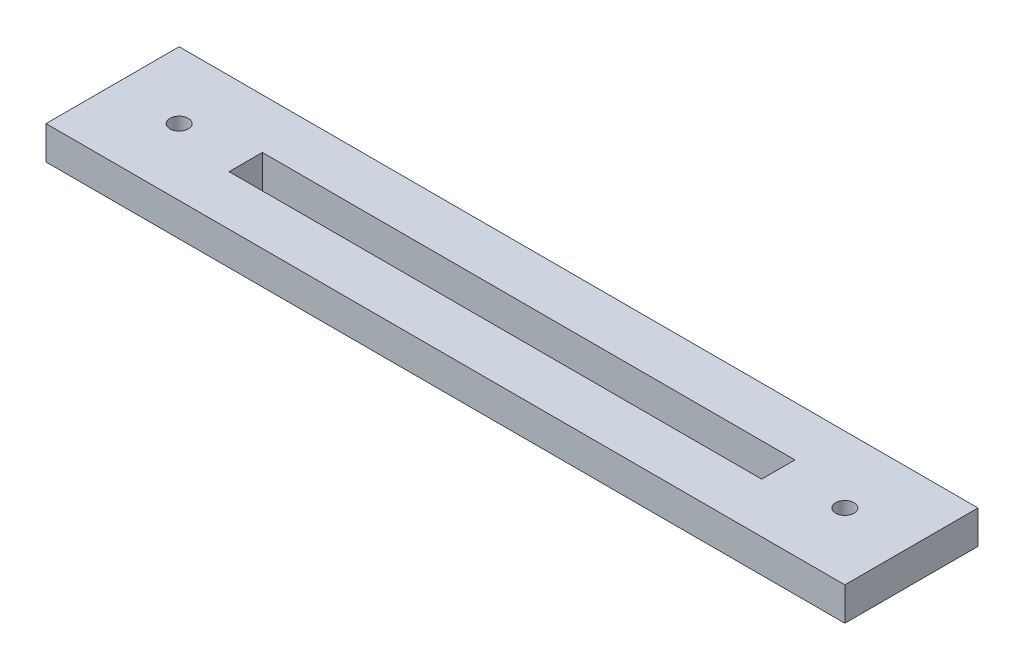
ISO-10303-21;
HEADER;
FILE_DESCRIPTION(('STEP AP214'),'2;1');
FILE_NAME('part.step','',(''),(''),'','','');
FILE_SCHEMA(('AUTOMOTIVE_DESIGN { 1 0 10303 214 1 1 1 1 }'));
ENDSEC;
DATA;
#1=APPLICATION_CONTEXT('core data for automotive mechanical design processes');
#2=APPLICATION_PROTOCOL_DEFINITION('international standard','automotive_design',2000,#1);
#3=PRODUCT_CONTEXT('',#1,'mechanical');
#4=PRODUCT('Part','Part','',(#3));
#5=PRODUCT_RELATED_PRODUCT_CATEGORY('part','',(#4));
#6=PRODUCT_DEFINITION_FORMATION('','',#4);
#7=PRODUCT_DEFINITION_CONTEXT('part definition',#1,'design');
#8=PRODUCT_DEFINITION('design','',#6,#7);
#9=PRODUCT_DEFINITION_SHAPE('','',#8);
#10=(LENGTH_UNIT() NAMED_UNIT(*) SI_UNIT(.MILLI.,.METRE.));
#11=(NAMED_UNIT(*) PLANE_ANGLE_UNIT() SI_UNIT($,.RADIAN.));
#12=(NAMED_UNIT(*) SI_UNIT($,.STERADIAN.) SOLID_ANGLE_UNIT());
#13=UNCERTAINTY_MEASURE_WITH_UNIT(LENGTH_MEASURE(1.E-05),#10,'distance_accuracy_value','');
#14=(GEOMETRIC_REPRESENTATION_CONTEXT(3) GLOBAL_UNCERTAINTY_ASSIGNED_CONTEXT((#13)) GLOBAL_UNIT_ASSIGNED_CONTEXT((#10,
#11,#12)) REPRESENTATION_CONTEXT('',''));
#15=CARTESIAN_POINT('',(0.,0.,0.));
#16=DIRECTION('',(0.,0.,1.));
#17=DIRECTION('',(1.,0.,0.));
#18=AXIS2_PLACEMENT_3D('',#15,#16,#17);
#19=CARTESIAN_POINT('',(0.,6.35,0.));
#20=DIRECTION('',(0.,-1.,0.));
#21=DIRECTION('',(0.,0.,-1.));
#22=AXIS2_PLACEMENT_3D('',#19,#20,#21);
#23=PLANE('',#22);
#24=DIRECTION('',(0.,0.,-1.));
#25=VECTOR('',#24,1.);
#26=CARTESIAN_POINT('',(76.2,6.35,12.7));
#27=LINE('',#26,#25);
#28=CARTESIAN_POINT('',(76.2,6.35,12.7));
#29=VERTEX_POINT('',#28);
#30=CARTESIAN_POINT('',(76.2,6.35,-12.7));
#31=VERTEX_POINT('',#30);
#32=EDGE_CURVE('E137',#29,#31,#27,.T.);
#33=ORIENTED_EDGE('',*,*,#32,.T.);
#34=DIRECTION('',(-1.,0.,0.));
#35=VECTOR('',#34,1.);
#36=CARTESIAN_POINT('',(-76.2,6.35,-12.7));
#37=LINE('',#36,#35);
#38=CARTESIAN_POINT('',(-76.2,6.35,-12.7));
#39=VERTEX_POINT('',#38);
#40=EDGE_CURVE('E140',#31,#39,#37,.T.);
#41=ORIENTED_EDGE('',*,*,#40,.T.);
#42=DIRECTION('',(0.,0.,1.));
#43=VECTOR('',#42,1.);
#44=CARTESIAN_POINT('',(-76.2,6.35,12.7));
#45=LINE('',#44,#43);
#46=CARTESIAN_POINT('',(-76.2,6.35,12.7));
#47=VERTEX_POINT('',#46);
#48=EDGE_CURVE('E143',#39,#47,#45,.T.);
#49=ORIENTED_EDGE('',*,*,#48,.T.);
#50=DIRECTION('',(1.,0.,0.));
#51=VECTOR('',#50,1.);
#52=CARTESIAN_POINT('',(-76.2,6.35,12.7));
#53=LINE('',#52,#51);
#54=EDGE_CURVE('E145',#47,#29,#53,.T.);
#55=ORIENTED_EDGE('',*,*,#54,.T.);
#56=EDGE_LOOP('',(#33,#41,#49,#55));
#57=FACE_BOUND('',#56,.T.);
#58=DIRECTION('',(0.,0.,-1.));
#59=VECTOR('',#58,1.);
#60=CARTESIAN_POINT('',(50.8,6.35,3.175));
#61=LINE('',#60,#59);
#62=CARTESIAN_POINT('',(50.8,6.35,3.175));
#63=VERTEX_POINT('',#62);
#64=CARTESIAN_POINT('',(50.8,6.35,-3.175));
#65=VERTEX_POINT('',#64);
#66=EDGE_CURVE('E98',#63,#65,#61,.T.);
#67=ORIENTED_EDGE('',*,*,#66,.F.);
#68=DIRECTION('',(1.,0.,0.));
#69=VECTOR('',#68,1.);
#70=CARTESIAN_POINT('',(-50.8,6.35,3.175));
#71=LINE('',#70,#69);
#72=CARTESIAN_POINT('',(-50.8,6.35,3.175));
#73=VERTEX_POINT('',#72);
#74=EDGE_CURVE('E121',#73,#63,#71,.T.);
#75=ORIENTED_EDGE('',*,*,#74,.F.);
#76=DIRECTION('',(0.,0.,1.));
#77=VECTOR('',#76,1.);
#78=CARTESIAN_POINT('',(-50.8,6.35,3.175));
#79=LINE('',#78,#77);
#80=CARTESIAN_POINT('',(-50.8,6.35,-3.175));
#81=VERTEX_POINT('',#80);
#82=EDGE_CURVE('E119',#81,#73,#79,.T.);
#83=ORIENTED_EDGE('',*,*,#82,.F.);
#84=DIRECTION('',(-1.,0.,0.));
#85=VECTOR('',#84,1.);
#86=CARTESIAN_POINT('',(-50.8,6.35,-3.175));
#87=LINE('',#86,#85);
#88=EDGE_CURVE('E106',#65,#81,#87,.T.);
#89=ORIENTED_EDGE('',*,*,#88,.F.);
#90=EDGE_LOOP('',(#67,#75,#83,#89));
#91=FACE_BOUND('',#90,.T.);
#92=CARTESIAN_POINT('',(63.5,6.35,0.));
#93=DIRECTION('',(0.,1.,0.));
#94=DIRECTION('',(0.,0.,1.));
#95=AXIS2_PLACEMENT_3D('',#92,#93,#94);
#96=CIRCLE('',#95,1.75);
#97=CARTESIAN_POINT('',(63.5,6.35,1.75));
#98=VERTEX_POINT('',#97);
#99=EDGE_CURVE('E127',#98,#98,#96,.T.);
#100=ORIENTED_EDGE('',*,*,#99,.F.);
#101=EDGE_LOOP('',(#100));
#102=FACE_BOUND('',#101,.T.);
#103=CARTESIAN_POINT('',(-63.5000000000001,6.35,0.));
#104=DIRECTION('',(0.,1.,0.));
#105=DIRECTION('',(0.,0.,-1.));
#106=AXIS2_PLACEMENT_3D('',#103,#104,#105);
#107=CIRCLE('',#106,1.75);
#108=CARTESIAN_POINT('',(-63.5000000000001,6.35,-1.75));
#109=VERTEX_POINT('',#108);
#110=EDGE_CURVE('E226',#109,#109,#107,.T.);
#111=ORIENTED_EDGE('',*,*,#110,.F.);
#112=EDGE_LOOP('',(#111));
#113=FACE_BOUND('',#112,.T.);
#114=ADVANCED_FACE('F33',(#57,#91,#102,#113),#23,.F.);
#115=CARTESIAN_POINT('',(0.,0.,0.));
#116=DIRECTION('',(0.,-1.,0.));
#117=DIRECTION('',(0.,0.,-1.));
#118=AXIS2_PLACEMENT_3D('',#115,#116,#117);
#119=PLANE('',#118);
#120=CARTESIAN_POINT('',(63.5,0.,0.));
#121=DIRECTION('',(0.,1.,0.));
#122=DIRECTION('',(0.,0.,1.));
#123=AXIS2_PLACEMENT_3D('',#120,#121,#122);
#124=CIRCLE('',#123,1.75);
#125=CARTESIAN_POINT('',(63.5,0.,1.75));
#126=VERTEX_POINT('',#125);
#127=EDGE_CURVE('E232',#126,#126,#124,.T.);
#128=ORIENTED_EDGE('',*,*,#127,.T.);
#129=EDGE_LOOP('',(#128));
#130=FACE_BOUND('',#129,.T.);
#131=DIRECTION('',(0.,0.,-1.));
#132=VECTOR('',#131,1.);
#133=CARTESIAN_POINT('',(76.2,0.,12.7));
#134=LINE('',#133,#132);
#135=CARTESIAN_POINT('',(76.2,0.,12.7));
#136=VERTEX_POINT('',#135);
#137=CARTESIAN_POINT('',(76.2,0.,-12.7));
#138=VERTEX_POINT('',#137);
#139=EDGE_CURVE('E114',#136,#138,#134,.T.);
#140=ORIENTED_EDGE('',*,*,#139,.F.);
#141=DIRECTION('',(1.,0.,0.));
#142=VECTOR('',#141,1.);
#143=CARTESIAN_POINT('',(-76.2,0.,12.7));
#144=LINE('',#143,#142);
#145=CARTESIAN_POINT('',(-76.2,0.,12.7));
#146=VERTEX_POINT('',#145);
#147=EDGE_CURVE('E141',#146,#136,#144,.T.);
#148=ORIENTED_EDGE('',*,*,#147,.F.);
#149=DIRECTION('',(0.,0.,1.));
#150=VECTOR('',#149,1.);
#151=CARTESIAN_POINT('',(-76.2,0.,12.7));
#152=LINE('',#151,#150);
#153=CARTESIAN_POINT('',(-76.2,0.,-12.7));
#154=VERTEX_POINT('',#153);
#155=EDGE_CURVE('E152',#154,#146,#152,.T.);
#156=ORIENTED_EDGE('',*,*,#155,.F.);
#157=DIRECTION('',(-1.,0.,0.));
#158=VECTOR('',#157,1.);
#159=CARTESIAN_POINT('',(-76.2,0.,-12.7));
#160=LINE('',#159,#158);
#161=EDGE_CURVE('E150',#138,#154,#160,.T.);
#162=ORIENTED_EDGE('',*,*,#161,.F.);
#163=EDGE_LOOP('',(#140,#148,#156,#162));
#164=FACE_BOUND('',#163,.T.);
#165=DIRECTION('',(1.,0.,0.));
#166=VECTOR('',#165,1.);
#167=CARTESIAN_POINT('',(-50.8,0.,3.175));
#168=LINE('',#167,#166);
#169=CARTESIAN_POINT('',(-50.8,0.,3.175));
#170=VERTEX_POINT('',#169);
#171=CARTESIAN_POINT('',(50.8,0.,3.175));
#172=VERTEX_POINT('',#171);
#173=EDGE_CURVE('E107',#170,#172,#168,.T.);
#174=ORIENTED_EDGE('',*,*,#173,.T.);
#175=DIRECTION('',(0.,0.,-1.));
#176=VECTOR('',#175,1.);
#177=CARTESIAN_POINT('',(50.8,0.,3.175));
#178=LINE('',#177,#176);
#179=CARTESIAN_POINT('',(50.8,0.,-3.175));
#180=VERTEX_POINT('',#179);
#181=EDGE_CURVE('E56',#172,#180,#178,.T.);
#182=ORIENTED_EDGE('',*,*,#181,.T.);
#183=DIRECTION('',(-1.,0.,0.));
#184=VECTOR('',#183,1.);
#185=CARTESIAN_POINT('',(-50.8,0.,-3.175));
#186=LINE('',#185,#184);
#187=CARTESIAN_POINT('',(-50.8,0.,-3.175));
#188=VERTEX_POINT('',#187);
#189=EDGE_CURVE('E113',#180,#188,#186,.T.);
#190=ORIENTED_EDGE('',*,*,#189,.T.);
#191=DIRECTION('',(0.,0.,1.));
#192=VECTOR('',#191,1.);
#193=CARTESIAN_POINT('',(-50.8,0.,3.175));
#194=LINE('',#193,#192);
#195=EDGE_CURVE('E129',#188,#170,#194,.T.);
#196=ORIENTED_EDGE('',*,*,#195,.T.);
#197=EDGE_LOOP('',(#174,#182,#190,#196));
#198=FACE_BOUND('',#197,.T.);
#199=CARTESIAN_POINT('',(-63.5000000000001,0.,0.));
#200=DIRECTION('',(0.,1.,0.));
#201=DIRECTION('',(0.,0.,-1.));
#202=AXIS2_PLACEMENT_3D('',#199,#200,#201);
#203=CIRCLE('',#202,1.75);
#204=CARTESIAN_POINT('',(-63.5000000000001,0.,-1.75));
#205=VERTEX_POINT('',#204);
#206=EDGE_CURVE('E229',#205,#205,#203,.T.);
#207=ORIENTED_EDGE('',*,*,#206,.T.);
#208=EDGE_LOOP('',(#207));
#209=FACE_BOUND('',#208,.T.);
#210=ADVANCED_FACE('F170',(#130,#164,#198,#209),#119,.T.);
#211=CARTESIAN_POINT('',(76.2,6.35,12.7));
#212=DIRECTION('',(-1.,0.,0.));
#213=DIRECTION('',(0.,0.,1.));
#214=AXIS2_PLACEMENT_3D('',#211,#212,#213);
#215=PLANE('',#214);
#216=ORIENTED_EDGE('',*,*,#139,.T.);
#217=DIRECTION('',(0.,-1.,0.));
#218=VECTOR('',#217,1.);
#219=CARTESIAN_POINT('',(76.2,6.35,-12.7));
#220=LINE('',#219,#218);
#221=EDGE_CURVE('E11',#31,#138,#220,.T.);
#222=ORIENTED_EDGE('',*,*,#221,.F.);
#223=ORIENTED_EDGE('',*,*,#32,.F.);
#224=DIRECTION('',(0.,-1.,0.));
#225=VECTOR('',#224,1.);
#226=CARTESIAN_POINT('',(76.2,6.35,12.7));
#227=LINE('',#226,#225);
#228=EDGE_CURVE('E147',#29,#136,#227,.T.);
#229=ORIENTED_EDGE('',*,*,#228,.T.);
#230=EDGE_LOOP('',(#216,#222,#223,#229));
#231=FACE_BOUND('',#230,.T.);
#232=ADVANCED_FACE('F35',(#231),#215,.F.);
#233=CARTESIAN_POINT('',(-76.2,6.35,-12.7));
#234=DIRECTION('',(0.,0.,1.));
#235=DIRECTION('',(1.,0.,0.));
#236=AXIS2_PLACEMENT_3D('',#233,#234,#235);
#237=PLANE('',#236);
#238=ORIENTED_EDGE('',*,*,#161,.T.);
#239=DIRECTION('',(0.,-1.,0.));
#240=VECTOR('',#239,1.);
#241=CARTESIAN_POINT('',(-76.2,6.35,-12.7));
#242=LINE('',#241,#240);
#243=EDGE_CURVE('E41',#39,#154,#242,.T.);
#244=ORIENTED_EDGE('',*,*,#243,.F.);
#245=ORIENTED_EDGE('',*,*,#40,.F.);
#246=ORIENTED_EDGE('',*,*,#221,.T.);
#247=EDGE_LOOP('',(#238,#244,#245,#246));
#248=FACE_BOUND('',#247,.T.);
#249=ADVANCED_FACE('F180',(#248),#237,.F.);
#250=CARTESIAN_POINT('',(-76.2,6.35,12.7));
#251=DIRECTION('',(1.,0.,0.));
#252=DIRECTION('',(0.,0.,-1.));
#253=AXIS2_PLACEMENT_3D('',#250,#251,#252);
#254=PLANE('',#253);
#255=ORIENTED_EDGE('',*,*,#155,.T.);
#256=DIRECTION('',(0.,-1.,0.));
#257=VECTOR('',#256,1.);
#258=CARTESIAN_POINT('',(-76.2,6.35,12.7));
#259=LINE('',#258,#257);
#260=EDGE_CURVE('E157',#47,#146,#259,.T.);
#261=ORIENTED_EDGE('',*,*,#260,.F.);
#262=ORIENTED_EDGE('',*,*,#48,.F.);
#263=ORIENTED_EDGE('',*,*,#243,.T.);
#264=EDGE_LOOP('',(#255,#261,#262,#263));
#265=FACE_BOUND('',#264,.T.);
#266=ADVANCED_FACE('F164',(#265),#254,.F.);
#267=CARTESIAN_POINT('',(-76.2,6.35,12.7));
#268=DIRECTION('',(0.,0.,-1.));
#269=DIRECTION('',(-1.,0.,0.));
#270=AXIS2_PLACEMENT_3D('',#267,#268,#269);
#271=PLANE('',#270);
#272=ORIENTED_EDGE('',*,*,#147,.T.);
#273=ORIENTED_EDGE('',*,*,#228,.F.);
#274=ORIENTED_EDGE('',*,*,#54,.F.);
#275=ORIENTED_EDGE('',*,*,#260,.T.);
#276=EDGE_LOOP('',(#272,#273,#274,#275));
#277=FACE_BOUND('',#276,.T.);
#278=ADVANCED_FACE('F174',(#277),#271,.F.);
#279=CARTESIAN_POINT('',(50.8,6.35,3.175));
#280=DIRECTION('',(-1.,0.,0.));
#281=DIRECTION('',(0.,0.,1.));
#282=AXIS2_PLACEMENT_3D('',#279,#280,#281);
#283=PLANE('',#282);
#284=ORIENTED_EDGE('',*,*,#181,.F.);
#285=DIRECTION('',(0.,-1.,0.));
#286=VECTOR('',#285,1.);
#287=CARTESIAN_POINT('',(50.8,6.35,3.175));
#288=LINE('',#287,#286);
#289=EDGE_CURVE('E102',#63,#172,#288,.T.);
#290=ORIENTED_EDGE('',*,*,#289,.F.);
#291=ORIENTED_EDGE('',*,*,#66,.T.);
#292=DIRECTION('',(0.,-1.,0.));
#293=VECTOR('',#292,1.);
#294=CARTESIAN_POINT('',(50.8,6.35,-3.175));
#295=LINE('',#294,#293);
#296=EDGE_CURVE('E101',#65,#180,#295,.T.);
#297=ORIENTED_EDGE('',*,*,#296,.T.);
#298=EDGE_LOOP('',(#284,#290,#291,#297));
#299=FACE_BOUND('',#298,.T.);
#300=ADVANCED_FACE('F100',(#299),#283,.T.);
#301=CARTESIAN_POINT('',(-50.8,6.35,-3.175));
#302=DIRECTION('',(0.,0.,1.));
#303=DIRECTION('',(1.,0.,0.));
#304=AXIS2_PLACEMENT_3D('',#301,#302,#303);
#305=PLANE('',#304);
#306=ORIENTED_EDGE('',*,*,#189,.F.);
#307=ORIENTED_EDGE('',*,*,#296,.F.);
#308=ORIENTED_EDGE('',*,*,#88,.T.);
#309=DIRECTION('',(0.,-1.,0.));
#310=VECTOR('',#309,1.);
#311=CARTESIAN_POINT('',(-50.8,6.35,-3.175));
#312=LINE('',#311,#310);
#313=EDGE_CURVE('E115',#81,#188,#312,.T.);
#314=ORIENTED_EDGE('',*,*,#313,.T.);
#315=EDGE_LOOP('',(#306,#307,#308,#314));
#316=FACE_BOUND('',#315,.T.);
#317=ADVANCED_FACE('F110',(#316),#305,.T.);
#318=CARTESIAN_POINT('',(-50.8,6.35,3.175));
#319=DIRECTION('',(1.,0.,0.));
#320=DIRECTION('',(0.,0.,-1.));
#321=AXIS2_PLACEMENT_3D('',#318,#319,#320);
#322=PLANE('',#321);
#323=ORIENTED_EDGE('',*,*,#195,.F.);
#324=ORIENTED_EDGE('',*,*,#313,.F.);
#325=ORIENTED_EDGE('',*,*,#82,.T.);
#326=DIRECTION('',(0.,-1.,0.));
#327=VECTOR('',#326,1.);
#328=CARTESIAN_POINT('',(-50.8,6.35,3.175));
#329=LINE('',#328,#327);
#330=EDGE_CURVE('E48',#73,#170,#329,.T.);
#331=ORIENTED_EDGE('',*,*,#330,.T.);
#332=EDGE_LOOP('',(#323,#324,#325,#331));
#333=FACE_BOUND('',#332,.T.);
#334=ADVANCED_FACE('F204',(#333),#322,.T.);
#335=CARTESIAN_POINT('',(-50.8,6.35,3.175));
#336=DIRECTION('',(0.,0.,-1.));
#337=DIRECTION('',(-1.,0.,0.));
#338=AXIS2_PLACEMENT_3D('',#335,#336,#337);
#339=PLANE('',#338);
#340=ORIENTED_EDGE('',*,*,#173,.F.);
#341=ORIENTED_EDGE('',*,*,#330,.F.);
#342=ORIENTED_EDGE('',*,*,#74,.T.);
#343=ORIENTED_EDGE('',*,*,#289,.T.);
#344=EDGE_LOOP('',(#340,#341,#342,#343));
#345=FACE_BOUND('',#344,.T.);
#346=ADVANCED_FACE('F208',(#345),#339,.T.);
#347=CARTESIAN_POINT('',(63.5,6.35,0.));
#348=DIRECTION('',(0.,-1.,0.));
#349=DIRECTION('',(0.,0.,-1.));
#350=AXIS2_PLACEMENT_3D('',#347,#348,#349);
#351=CYLINDRICAL_SURFACE('',#350,1.75);
#352=ORIENTED_EDGE('',*,*,#99,.T.);
#353=EDGE_LOOP('',(#352));
#354=FACE_BOUND('',#353,.T.);
#355=ORIENTED_EDGE('',*,*,#127,.F.);
#356=EDGE_LOOP('',(#355));
#357=FACE_BOUND('',#356,.T.);
#358=ADVANCED_FACE('F214',(#354,#357),#351,.F.);
#359=CARTESIAN_POINT('',(-63.5000000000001,6.35,0.));
#360=DIRECTION('',(0.,-1.,0.));
#361=DIRECTION('',(0.,0.,-1.));
#362=AXIS2_PLACEMENT_3D('',#359,#360,#361);
#363=CYLINDRICAL_SURFACE('',#362,1.75);
#364=ORIENTED_EDGE('',*,*,#110,.T.);
#365=EDGE_LOOP('',(#364));
#366=FACE_BOUND('',#365,.T.);
#367=ORIENTED_EDGE('',*,*,#206,.F.);
#368=EDGE_LOOP('',(#367));
#369=FACE_BOUND('',#368,.T.);
#370=ADVANCED_FACE('F217',(#366,#369),#363,.F.);
#371=CLOSED_SHELL('',(#114,#210,#232,#249,#266,#278,#300,#317,#334,#346,#358,#370));
#372=MANIFOLD_SOLID_BREP('B2',#371);
#373=ADVANCED_BREP_SHAPE_REPRESENTATION('',(#18,#372),#14);
#374=SHAPE_DEFINITION_REPRESENTATION(#9,#373);
ENDSEC;
END-ISO-10303-21;
